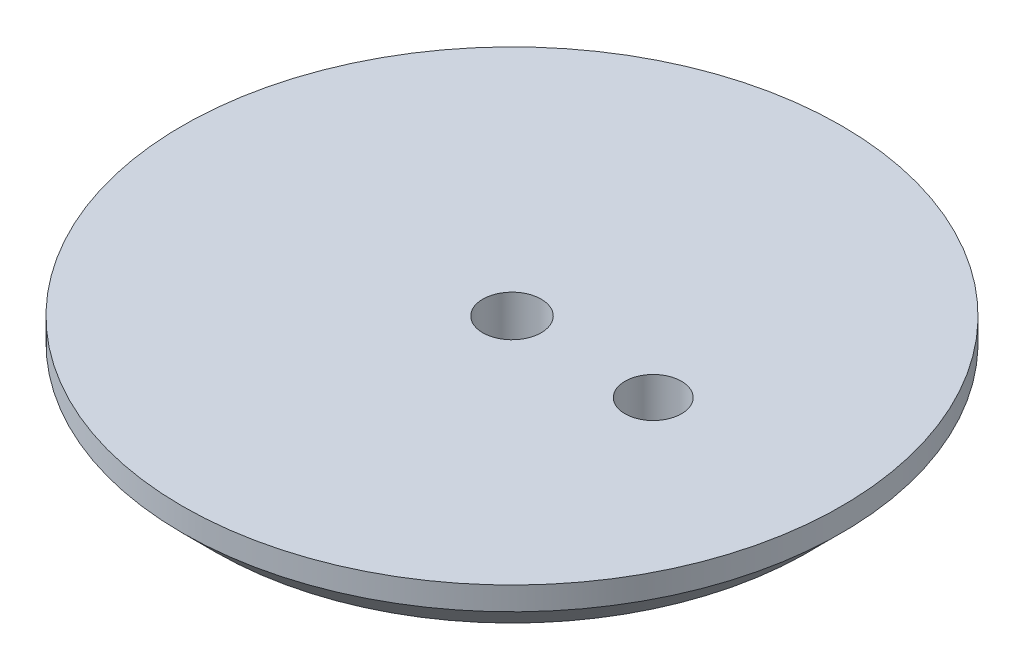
from build123d import *

# Parameters (mm, degrees)
ESQUISSE2_R             = 3.1
ENL_V_MAT_EXTRU_1_DEPTH = 50.859803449
ESQUISSE3_R             = 3
ENL_V_MAT_EXTRU_2_DEPTH = 10


with BuildPart() as part:
    # Esquisse1 → R_volution1 (revolve)
    with BuildSketch(Plane.XY, mode=Mode.PRIVATE) as r_volution1_sk:
        Polygon((35, 6), (0, 6), (0, 0), (31.464466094, 0), (35, 3.535533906), align=None)
    revolve(r_volution1_sk.sketch.rotate(Axis((0, 18.075916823, 0), (0, -1, 0)), 90), axis=Axis((0, 18.075916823, 0), (0, -1, 0)))

    # Esquisse2 → Enl_v. mat.-Extru.1 (cut, through all)
    with BuildSketch(Plane(origin=(0, 6, 0), x_dir=(-1, 0, 0), z_dir=(0, 1, 0))):
        with Locations(Location((0, 0, 0), (0, 0, 90))):
            Circle(ESQUISSE2_R)
    extrude(amount=-ENL_V_MAT_EXTRU_1_DEPTH, mode=Mode.SUBTRACT)

    # Esquisse3 → Enl_v. mat.-Extru.2 (cut)
    with BuildSketch(Plane(origin=(0, 6, 0), x_dir=(-1, 0, 0), z_dir=(0, 1, 0))):
        with Locations(Location((-15, 0, 0), (0, 0, 90))):
            Circle(ESQUISSE3_R)
    extrude(amount=-ENL_V_MAT_EXTRU_2_DEPTH, mode=Mode.SUBTRACT)


solid = part.part
